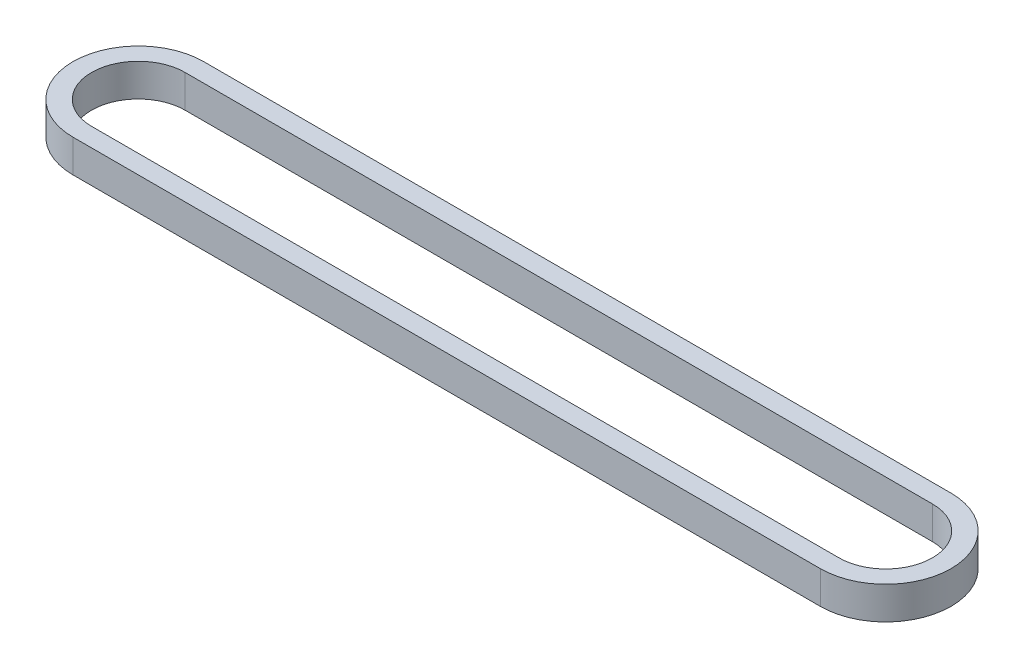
ISO-10303-21;
HEADER;
FILE_DESCRIPTION(('STEP AP214'),'2;1');
FILE_NAME('part.step','',(''),(''),'','','');
FILE_SCHEMA(('AUTOMOTIVE_DESIGN { 1 0 10303 214 1 1 1 1 }'));
ENDSEC;
DATA;
#1=APPLICATION_CONTEXT('core data for automotive mechanical design processes');
#2=APPLICATION_PROTOCOL_DEFINITION('international standard','automotive_design',2000,#1);
#3=PRODUCT_CONTEXT('',#1,'mechanical');
#4=PRODUCT('Part','Part','',(#3));
#5=PRODUCT_RELATED_PRODUCT_CATEGORY('part','',(#4));
#6=PRODUCT_DEFINITION_FORMATION('','',#4);
#7=PRODUCT_DEFINITION_CONTEXT('part definition',#1,'design');
#8=PRODUCT_DEFINITION('design','',#6,#7);
#9=PRODUCT_DEFINITION_SHAPE('','',#8);
#10=(LENGTH_UNIT() NAMED_UNIT(*) SI_UNIT(.MILLI.,.METRE.));
#11=(NAMED_UNIT(*) PLANE_ANGLE_UNIT() SI_UNIT($,.RADIAN.));
#12=(NAMED_UNIT(*) SI_UNIT($,.STERADIAN.) SOLID_ANGLE_UNIT());
#13=UNCERTAINTY_MEASURE_WITH_UNIT(LENGTH_MEASURE(1.E-05),#10,'distance_accuracy_value','');
#14=(GEOMETRIC_REPRESENTATION_CONTEXT(3) GLOBAL_UNCERTAINTY_ASSIGNED_CONTEXT((#13)) GLOBAL_UNIT_ASSIGNED_CONTEXT((#10,
#11,#12)) REPRESENTATION_CONTEXT('',''));
#15=CARTESIAN_POINT('',(0.,0.,0.));
#16=DIRECTION('',(0.,0.,1.));
#17=DIRECTION('',(1.,0.,0.));
#18=AXIS2_PLACEMENT_3D('',#15,#16,#17);
#19=CARTESIAN_POINT('',(0.,3.5,0.));
#20=DIRECTION('',(0.,1.,0.));
#21=DIRECTION('',(0.,0.,1.));
#22=AXIS2_PLACEMENT_3D('',#19,#20,#21);
#23=PLANE('',#22);
#24=CARTESIAN_POINT('',(0.,3.5,0.));
#25=DIRECTION('',(0.,1.,0.));
#26=DIRECTION('',(0.,0.,1.));
#27=AXIS2_PLACEMENT_3D('',#24,#25,#26);
#28=CIRCLE('',#27,7.);
#29=CARTESIAN_POINT('',(0.,3.5,7.));
#30=VERTEX_POINT('',#29);
#31=CARTESIAN_POINT('',(0.,3.5,-7.));
#32=VERTEX_POINT('',#31);
#33=EDGE_CURVE('E159',#30,#32,#28,.T.);
#34=ORIENTED_EDGE('',*,*,#33,.T.);
#35=DIRECTION('',(-1.,0.,0.));
#36=VECTOR('',#35,1.);
#37=CARTESIAN_POINT('',(0.,3.5,-7.));
#38=LINE('',#37,#36);
#39=CARTESIAN_POINT('',(-80.01,3.5,-6.99999999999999));
#40=VERTEX_POINT('',#39);
#41=EDGE_CURVE('E163',#32,#40,#38,.T.);
#42=ORIENTED_EDGE('',*,*,#41,.T.);
#43=CARTESIAN_POINT('',(-80.01,3.5,0.));
#44=DIRECTION('',(0.,1.,0.));
#45=DIRECTION('',(0.,0.,1.));
#46=AXIS2_PLACEMENT_3D('',#43,#44,#45);
#47=CIRCLE('',#46,7.);
#48=CARTESIAN_POINT('',(-80.01,3.5,7.00000000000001));
#49=VERTEX_POINT('',#48);
#50=EDGE_CURVE('E167',#40,#49,#47,.T.);
#51=ORIENTED_EDGE('',*,*,#50,.T.);
#52=DIRECTION('',(1.,0.,0.));
#53=VECTOR('',#52,1.);
#54=CARTESIAN_POINT('',(0.,3.5,7.));
#55=LINE('',#54,#53);
#56=EDGE_CURVE('E170',#49,#30,#55,.T.);
#57=ORIENTED_EDGE('',*,*,#56,.T.);
#58=EDGE_LOOP('',(#34,#42,#51,#57));
#59=FACE_BOUND('',#58,.T.);
#60=DIRECTION('',(-1.,0.,0.));
#61=VECTOR('',#60,1.);
#62=CARTESIAN_POINT('',(0.,3.5,-5.));
#63=LINE('',#62,#61);
#64=CARTESIAN_POINT('',(0.,3.5,-5.));
#65=VERTEX_POINT('',#64);
#66=CARTESIAN_POINT('',(-80.01,3.5,-4.99999999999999));
#67=VERTEX_POINT('',#66);
#68=EDGE_CURVE('E120',#65,#67,#63,.T.);
#69=ORIENTED_EDGE('',*,*,#68,.F.);
#70=CARTESIAN_POINT('',(0.,3.5,0.));
#71=DIRECTION('',(0.,1.,0.));
#72=DIRECTION('',(0.,0.,1.));
#73=AXIS2_PLACEMENT_3D('',#70,#71,#72);
#74=CIRCLE('',#73,5.);
#75=CARTESIAN_POINT('',(0.,3.5,5.));
#76=VERTEX_POINT('',#75);
#77=EDGE_CURVE('E111',#76,#65,#74,.T.);
#78=ORIENTED_EDGE('',*,*,#77,.F.);
#79=DIRECTION('',(1.,0.,0.));
#80=VECTOR('',#79,1.);
#81=CARTESIAN_POINT('',(0.,3.5,5.));
#82=LINE('',#81,#80);
#83=CARTESIAN_POINT('',(-80.01,3.5,5.00000000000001));
#84=VERTEX_POINT('',#83);
#85=EDGE_CURVE('E137',#84,#76,#82,.T.);
#86=ORIENTED_EDGE('',*,*,#85,.F.);
#87=CARTESIAN_POINT('',(-80.01,3.5,0.));
#88=DIRECTION('',(0.,1.,0.));
#89=DIRECTION('',(0.,0.,1.));
#90=AXIS2_PLACEMENT_3D('',#87,#88,#89);
#91=CIRCLE('',#90,5.);
#92=EDGE_CURVE('E133',#67,#84,#91,.T.);
#93=ORIENTED_EDGE('',*,*,#92,.F.);
#94=EDGE_LOOP('',(#69,#78,#86,#93));
#95=FACE_BOUND('',#94,.T.);
#96=ADVANCED_FACE('F45',(#59,#95),#23,.T.);
#97=CARTESIAN_POINT('',(0.,0.,0.));
#98=DIRECTION('',(0.,1.,0.));
#99=DIRECTION('',(0.,0.,1.));
#100=AXIS2_PLACEMENT_3D('',#97,#98,#99);
#101=PLANE('',#100);
#102=CARTESIAN_POINT('',(0.,0.,0.));
#103=DIRECTION('',(0.,1.,0.));
#104=DIRECTION('',(0.,0.,1.));
#105=AXIS2_PLACEMENT_3D('',#102,#103,#104);
#106=CIRCLE('',#105,7.);
#107=CARTESIAN_POINT('',(0.,0.,7.));
#108=VERTEX_POINT('',#107);
#109=CARTESIAN_POINT('',(0.,0.,-7.));
#110=VERTEX_POINT('',#109);
#111=EDGE_CURVE('E129',#108,#110,#106,.T.);
#112=ORIENTED_EDGE('',*,*,#111,.F.);
#113=DIRECTION('',(1.,0.,0.));
#114=VECTOR('',#113,1.);
#115=CARTESIAN_POINT('',(0.,0.,7.));
#116=LINE('',#115,#114);
#117=CARTESIAN_POINT('',(-80.01,0.,7.00000000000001));
#118=VERTEX_POINT('',#117);
#119=EDGE_CURVE('E164',#118,#108,#116,.T.);
#120=ORIENTED_EDGE('',*,*,#119,.F.);
#121=CARTESIAN_POINT('',(-80.01,0.,0.));
#122=DIRECTION('',(0.,1.,0.));
#123=DIRECTION('',(0.,0.,1.));
#124=AXIS2_PLACEMENT_3D('',#121,#122,#123);
#125=CIRCLE('',#124,7.);
#126=CARTESIAN_POINT('',(-80.01,0.,-6.99999999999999));
#127=VERTEX_POINT('',#126);
#128=EDGE_CURVE('E180',#127,#118,#125,.T.);
#129=ORIENTED_EDGE('',*,*,#128,.F.);
#130=DIRECTION('',(-1.,0.,0.));
#131=VECTOR('',#130,1.);
#132=CARTESIAN_POINT('',(0.,0.,-7.));
#133=LINE('',#132,#131);
#134=EDGE_CURVE('E177',#110,#127,#133,.T.);
#135=ORIENTED_EDGE('',*,*,#134,.F.);
#136=EDGE_LOOP('',(#112,#120,#129,#135));
#137=FACE_BOUND('',#136,.T.);
#138=CARTESIAN_POINT('',(0.,0.,0.));
#139=DIRECTION('',(0.,1.,0.));
#140=DIRECTION('',(0.,0.,1.));
#141=AXIS2_PLACEMENT_3D('',#138,#139,#140);
#142=CIRCLE('',#141,5.);
#143=CARTESIAN_POINT('',(0.,0.,5.));
#144=VERTEX_POINT('',#143);
#145=CARTESIAN_POINT('',(0.,0.,-5.));
#146=VERTEX_POINT('',#145);
#147=EDGE_CURVE('E69',#144,#146,#142,.T.);
#148=ORIENTED_EDGE('',*,*,#147,.T.);
#149=DIRECTION('',(-1.,0.,0.));
#150=VECTOR('',#149,1.);
#151=CARTESIAN_POINT('',(0.,0.,-5.));
#152=LINE('',#151,#150);
#153=CARTESIAN_POINT('',(-80.01,0.,-4.99999999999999));
#154=VERTEX_POINT('',#153);
#155=EDGE_CURVE('E127',#146,#154,#152,.T.);
#156=ORIENTED_EDGE('',*,*,#155,.T.);
#157=CARTESIAN_POINT('',(-80.01,0.,0.));
#158=DIRECTION('',(0.,1.,0.));
#159=DIRECTION('',(0.,0.,1.));
#160=AXIS2_PLACEMENT_3D('',#157,#158,#159);
#161=CIRCLE('',#160,5.);
#162=CARTESIAN_POINT('',(-80.01,0.,5.00000000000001));
#163=VERTEX_POINT('',#162);
#164=EDGE_CURVE('E146',#154,#163,#161,.T.);
#165=ORIENTED_EDGE('',*,*,#164,.T.);
#166=DIRECTION('',(1.,0.,0.));
#167=VECTOR('',#166,1.);
#168=CARTESIAN_POINT('',(0.,0.,5.));
#169=LINE('',#168,#167);
#170=EDGE_CURVE('E121',#163,#144,#169,.T.);
#171=ORIENTED_EDGE('',*,*,#170,.T.);
#172=EDGE_LOOP('',(#148,#156,#165,#171));
#173=FACE_BOUND('',#172,.T.);
#174=ADVANCED_FACE('F203',(#137,#173),#101,.F.);
#175=CARTESIAN_POINT('',(0.,3.5,0.));
#176=DIRECTION('',(0.,-1.,0.));
#177=DIRECTION('',(0.,0.,-1.));
#178=AXIS2_PLACEMENT_3D('',#175,#176,#177);
#179=CYLINDRICAL_SURFACE('',#178,7.);
#180=ORIENTED_EDGE('',*,*,#111,.T.);
#181=DIRECTION('',(0.,-1.,0.));
#182=VECTOR('',#181,1.);
#183=CARTESIAN_POINT('',(0.,3.5,-7.));
#184=LINE('',#183,#182);
#185=EDGE_CURVE('E11',#32,#110,#184,.T.);
#186=ORIENTED_EDGE('',*,*,#185,.F.);
#187=ORIENTED_EDGE('',*,*,#33,.F.);
#188=DIRECTION('',(0.,-1.,0.));
#189=VECTOR('',#188,1.);
#190=CARTESIAN_POINT('',(0.,3.5,7.));
#191=LINE('',#190,#189);
#192=EDGE_CURVE('E173',#30,#108,#191,.T.);
#193=ORIENTED_EDGE('',*,*,#192,.T.);
#194=EDGE_LOOP('',(#180,#186,#187,#193));
#195=FACE_BOUND('',#194,.T.);
#196=ADVANCED_FACE('F47',(#195),#179,.T.);
#197=CARTESIAN_POINT('',(0.,3.5,-7.));
#198=DIRECTION('',(0.,0.,1.));
#199=DIRECTION('',(1.,0.,0.));
#200=AXIS2_PLACEMENT_3D('',#197,#198,#199);
#201=PLANE('',#200);
#202=ORIENTED_EDGE('',*,*,#134,.T.);
#203=DIRECTION('',(0.,-1.,0.));
#204=VECTOR('',#203,1.);
#205=CARTESIAN_POINT('',(-80.01,3.5,-6.99999999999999));
#206=LINE('',#205,#204);
#207=EDGE_CURVE('E54',#40,#127,#206,.T.);
#208=ORIENTED_EDGE('',*,*,#207,.F.);
#209=ORIENTED_EDGE('',*,*,#41,.F.);
#210=ORIENTED_EDGE('',*,*,#185,.T.);
#211=EDGE_LOOP('',(#202,#208,#209,#210));
#212=FACE_BOUND('',#211,.T.);
#213=ADVANCED_FACE('F213',(#212),#201,.F.);
#214=CARTESIAN_POINT('',(-80.01,3.5,0.));
#215=DIRECTION('',(0.,-1.,0.));
#216=DIRECTION('',(0.,0.,-1.));
#217=AXIS2_PLACEMENT_3D('',#214,#215,#216);
#218=CYLINDRICAL_SURFACE('',#217,7.);
#219=ORIENTED_EDGE('',*,*,#128,.T.);
#220=DIRECTION('',(0.,-1.,0.));
#221=VECTOR('',#220,1.);
#222=CARTESIAN_POINT('',(-80.01,3.5,7.00000000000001));
#223=LINE('',#222,#221);
#224=EDGE_CURVE('E188',#49,#118,#223,.T.);
#225=ORIENTED_EDGE('',*,*,#224,.F.);
#226=ORIENTED_EDGE('',*,*,#50,.F.);
#227=ORIENTED_EDGE('',*,*,#207,.T.);
#228=EDGE_LOOP('',(#219,#225,#226,#227));
#229=FACE_BOUND('',#228,.T.);
#230=ADVANCED_FACE('F197',(#229),#218,.T.);
#231=CARTESIAN_POINT('',(0.,3.5,7.));
#232=DIRECTION('',(0.,0.,-1.));
#233=DIRECTION('',(-1.,0.,0.));
#234=AXIS2_PLACEMENT_3D('',#231,#232,#233);
#235=PLANE('',#234);
#236=ORIENTED_EDGE('',*,*,#119,.T.);
#237=ORIENTED_EDGE('',*,*,#192,.F.);
#238=ORIENTED_EDGE('',*,*,#56,.F.);
#239=ORIENTED_EDGE('',*,*,#224,.T.);
#240=EDGE_LOOP('',(#236,#237,#238,#239));
#241=FACE_BOUND('',#240,.T.);
#242=ADVANCED_FACE('F207',(#241),#235,.F.);
#243=CARTESIAN_POINT('',(0.,3.5,0.));
#244=DIRECTION('',(0.,-1.,0.));
#245=DIRECTION('',(0.,0.,-1.));
#246=AXIS2_PLACEMENT_3D('',#243,#244,#245);
#247=CYLINDRICAL_SURFACE('',#246,5.);
#248=ORIENTED_EDGE('',*,*,#147,.F.);
#249=DIRECTION('',(0.,-1.,0.));
#250=VECTOR('',#249,1.);
#251=CARTESIAN_POINT('',(0.,3.5,5.));
#252=LINE('',#251,#250);
#253=EDGE_CURVE('E115',#76,#144,#252,.T.);
#254=ORIENTED_EDGE('',*,*,#253,.F.);
#255=ORIENTED_EDGE('',*,*,#77,.T.);
#256=DIRECTION('',(0.,-1.,0.));
#257=VECTOR('',#256,1.);
#258=CARTESIAN_POINT('',(0.,3.5,-5.));
#259=LINE('',#258,#257);
#260=EDGE_CURVE('E114',#65,#146,#259,.T.);
#261=ORIENTED_EDGE('',*,*,#260,.T.);
#262=EDGE_LOOP('',(#248,#254,#255,#261));
#263=FACE_BOUND('',#262,.T.);
#264=ADVANCED_FACE('F113',(#263),#247,.F.);
#265=CARTESIAN_POINT('',(0.,3.5,-5.));
#266=DIRECTION('',(0.,0.,1.));
#267=DIRECTION('',(1.,0.,0.));
#268=AXIS2_PLACEMENT_3D('',#265,#266,#267);
#269=PLANE('',#268);
#270=ORIENTED_EDGE('',*,*,#155,.F.);
#271=ORIENTED_EDGE('',*,*,#260,.F.);
#272=ORIENTED_EDGE('',*,*,#68,.T.);
#273=DIRECTION('',(0.,-1.,0.));
#274=VECTOR('',#273,1.);
#275=CARTESIAN_POINT('',(-80.01,3.5,-4.99999999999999));
#276=LINE('',#275,#274);
#277=EDGE_CURVE('E130',#67,#154,#276,.T.);
#278=ORIENTED_EDGE('',*,*,#277,.T.);
#279=EDGE_LOOP('',(#270,#271,#272,#278));
#280=FACE_BOUND('',#279,.T.);
#281=ADVANCED_FACE('F124',(#280),#269,.T.);
#282=CARTESIAN_POINT('',(-80.01,3.5,0.));
#283=DIRECTION('',(0.,-1.,0.));
#284=DIRECTION('',(0.,0.,-1.));
#285=AXIS2_PLACEMENT_3D('',#282,#283,#284);
#286=CYLINDRICAL_SURFACE('',#285,5.);
#287=ORIENTED_EDGE('',*,*,#164,.F.);
#288=ORIENTED_EDGE('',*,*,#277,.F.);
#289=ORIENTED_EDGE('',*,*,#92,.T.);
#290=DIRECTION('',(0.,-1.,0.));
#291=VECTOR('',#290,1.);
#292=CARTESIAN_POINT('',(-80.01,3.5,5.00000000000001));
#293=LINE('',#292,#291);
#294=EDGE_CURVE('E61',#84,#163,#293,.T.);
#295=ORIENTED_EDGE('',*,*,#294,.T.);
#296=EDGE_LOOP('',(#287,#288,#289,#295));
#297=FACE_BOUND('',#296,.T.);
#298=ADVANCED_FACE('F236',(#297),#286,.F.);
#299=CARTESIAN_POINT('',(0.,3.5,5.));
#300=DIRECTION('',(0.,0.,-1.));
#301=DIRECTION('',(-1.,0.,0.));
#302=AXIS2_PLACEMENT_3D('',#299,#300,#301);
#303=PLANE('',#302);
#304=ORIENTED_EDGE('',*,*,#170,.F.);
#305=ORIENTED_EDGE('',*,*,#294,.F.);
#306=ORIENTED_EDGE('',*,*,#85,.T.);
#307=ORIENTED_EDGE('',*,*,#253,.T.);
#308=EDGE_LOOP('',(#304,#305,#306,#307));
#309=FACE_BOUND('',#308,.T.);
#310=ADVANCED_FACE('F240',(#309),#303,.T.);
#311=CLOSED_SHELL('',(#96,#174,#196,#213,#230,#242,#264,#281,#298,#310));
#312=MANIFOLD_SOLID_BREP('B2',#311);
#313=ADVANCED_BREP_SHAPE_REPRESENTATION('',(#18,#312),#14);
#314=SHAPE_DEFINITION_REPRESENTATION(#9,#313);
ENDSEC;
END-ISO-10303-21;
